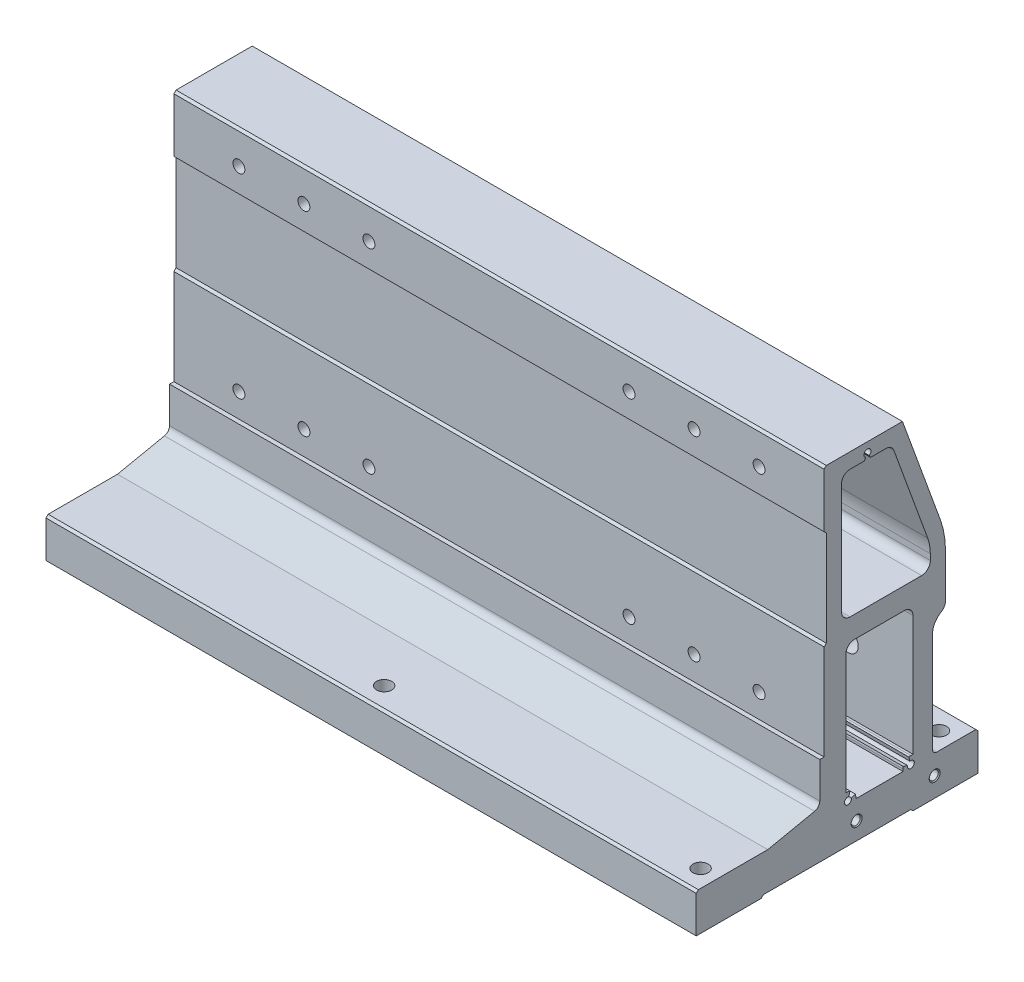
from build123d import *

# Parameters (mm, degrees)
EXTRUDE_1_DEPTH                = 150
HOLE_WIZARD_M5_1_D             = 4.2
HOLE_WIZARD_M5_1_DEPTH         = 12
HOLE_WIZARD_M5_1_CSINK_D       = 5.05
HOLE_WIZARD_M5_1_CSINK_ANGLE   = 90
HOLE_WIZARD_M5_1_TIP           = 1.2618073
HOLE_WIZARD_M5_1_2_D           = 5.5
HOLE_WIZARD_M5_1_2_CBORE_D     = 9.5
HOLE_WIZARD_M5_1_2_CBORE_DEPTH = 49
PATTERN_LINEAR_1_COUNT         = 2
PATTERN_LINEAR_1_PITCH         = 180
F_5_0MM_1_D                    = 5
F_5_0MM_1_DEPTH                = 10
F_5_0MM_1_TIP                  = 1.502151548
HOLE_WIZARD_7_0_7_1_D          = 7


with BuildPart() as part:
    # Sketch 2 → Extrude 1 (new, symmetric)
    with BuildSketch(Plane(origin=(0, 0, 0), x_dir=(0, 0, -1), z_dir=(1, 0, 0))):
        with BuildLine():
            Line((65, 16), (64, 17))
            Line((64, 17), (46, 17))
            ThreePointArc((46, 17), (44.585786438, 17.585786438), (44, 19))
            Line((44, 19), (44, 65))
            ThreePointArc((44, 65), (45.07179677, 69), (48, 71.92820323))
            ThreePointArc((48, 71.92820323), (49.464101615, 73.392304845), (50, 75.392304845))
            Line((50, 75.392304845), (50, 95.442037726))
            ThreePointArc((50, 95.442037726), (49.391487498, 102.392628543), (47.584464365, 109.131743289))
            Line((47.584464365, 109.131743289), (30.149007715, 156.999997))
            Line((30.149007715, 156.999997), (-5, 156.999997))
            Line((-5, 156.999997), (-6, 155.999997))
            Line((-6, 155.999997), (-6, 131))
            Line((-6, 131), (-5, 130))
            Line((-5, 130), (-5, 86))
            Line((-5, 86), (-6, 85))
            Line((-6, 85), (-6, 40.999831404))
            Line((-6, 40.999831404), (-8, 40.999831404))
            Line((-8, 40.999831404), (-8, 24.439412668))
            ThreePointArc((-8, 24.439412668), (-8.672384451, 22.546741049), (-10.388137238, 21.502471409))
            Line((-10.388137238, 21.502471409), (-32, 17))
            Line((-32, 17), (-64, 17))
            Line((-64, 17), (-65, 16))
            Line((-65, 16), (-65, -1))
            Line((-65, -1), (-35, -1))
            Line((-35, -1), (-34, 0))
            Line((-34, 0), (34, 0))
            Line((34, 0), (35, -1))
            Line((35, -1), (65, -1))
            Line((65, -1), (65, 16))
        make_face()
        with BuildLine():
            Line((2, 146), (2, 95))
            ThreePointArc((2, 95), (3.171572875, 92.171572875), (6, 91))
            Line((6, 91), (39, 91))
            ThreePointArc((39, 91), (41.828427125, 92.171572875), (43, 95))
            Line((43, 95), (43, 97.735875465))
            ThreePointArc((43, 97.735875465), (42.695743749, 101.211170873), (41.792232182, 104.580728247))
            Line((41.792232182, 104.580728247), (26.207110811, 147.368970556))
            ThreePointArc((26.207110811, 147.368970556), (24.742582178, 149.276879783), (22.448664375, 150))
            Line((22.448664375, 150), (15.443373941, 150))
            Line((15.443373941, 150), (14.8, 151.114356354))
            ThreePointArc((14.8, 151.114356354), (14, 154.099997), (13.2, 151.114356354))
            Line((13.2, 151.114356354), (12.556626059, 150))
            Line((12.556626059, 150), (6, 150))
            ThreePointArc((6, 150), (3.171572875, 148.828427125), (2, 146))
        make_face(mode=Mode.SUBTRACT)
        with BuildLine():
            Line((4, 21.6), (4, 77))
            ThreePointArc((4, 77), (5.171572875, 79.828427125), (8, 81))
            Line((8, 81), (31, 81))
            ThreePointArc((31, 81), (33.828427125, 79.828427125), (35, 77))
            Line((35, 77), (35, 21.6))
            Line((35, 21.6), (34, 21.6))
            ThreePointArc((34, 21.6), (33.530105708, 21.569201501), (33.068251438, 21.477332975))
            Line((33.068251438, 21.477332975), (33.585889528, 19.545481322))
            ThreePointArc((33.585889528, 19.545481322), (35.13137085, 16.86862915), (32.454518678, 18.414110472))
            Line((32.454518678, 18.414110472), (30.522667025, 18.931748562))
            ThreePointArc((30.522667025, 18.931748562), (30.430798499, 18.469894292), (30.4, 18))
            Line((30.4, 18), (30.4, 17))
            Line((30.4, 17), (8.6, 17))
            Line((8.6, 17), (8.6, 18))
            ThreePointArc((8.6, 18), (8.569201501, 18.469894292), (8.477332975, 18.931748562))
            Line((8.477332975, 18.931748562), (6.545481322, 18.414110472))
            ThreePointArc((6.545481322, 18.414110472), (3.86862915, 16.86862915), (5.414110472, 19.545481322))
            Line((5.414110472, 19.545481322), (5.931748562, 21.477332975))
            ThreePointArc((5.931748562, 21.477332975), (5.469894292, 21.569201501), (5, 21.6))
            Line((5, 21.6), (4, 21.6))
        make_face(mode=Mode.SUBTRACT)
    extrude(amount=EXTRUDE_1_DEPTH, both=True)

    # Hole Wizard M5 _ _1
    with Locations(Plane(origin=(150, 0, 0), x_dir=(0, 0, -1), z_dir=(1, 0, 0))):
        with Locations((45, 8), (9, 8)):
            CounterSinkHole(HOLE_WIZARD_M5_1_D / 2, HOLE_WIZARD_M5_1_CSINK_D / 2, depth=HOLE_WIZARD_M5_1_DEPTH, counter_sink_angle=HOLE_WIZARD_M5_1_CSINK_ANGLE)
            with Locations((0, 0, -(HOLE_WIZARD_M5_1_DEPTH + HOLE_WIZARD_M5_1_TIP / 2))):  # 118° drill point
                Cone(0, HOLE_WIZARD_M5_1_D / 2, HOLE_WIZARD_M5_1_TIP, mode=Mode.SUBTRACT)

    # Hole Wizard M5 _ _ _ _ _1 2 (through all)
    with Locations(Plane(origin=(0, 0, -50), x_dir=(-1, 0, 0), z_dir=(0, 0, -1))):
        with Locations((-120, 142), (-90, 142), (-60, 142), (-120, 52), (-90, 52), (-60, 52)):
            hole_wizard_m5_1_2 = CounterBoreHole(HOLE_WIZARD_M5_1_2_D / 2, HOLE_WIZARD_M5_1_2_CBORE_D / 2, HOLE_WIZARD_M5_1_2_CBORE_DEPTH)

    # Pattern Linear 1: Hole Wizard M5 _ _ _ _ _1 2 ×2
    with Locations(*[(-i * PATTERN_LINEAR_1_PITCH, 0, 0) for i in range(1, PATTERN_LINEAR_1_COUNT)]):
        add(hole_wizard_m5_1_2, mode=Mode.SUBTRACT)

    # 5.0mm _ _1
    with Locations(Plane(origin=(0, 0, 0), x_dir=(-1, 0, 0), z_dir=(0, -1, 0))):
        with Locations((4, 0), (-142, 0)):
            Hole(F_5_0MM_1_D / 2, depth=F_5_0MM_1_DEPTH)
            with Locations((0, 0, -(F_5_0MM_1_DEPTH + F_5_0MM_1_TIP / 2))):  # 118° drill point
                Cone(0, F_5_0MM_1_D / 2, F_5_0MM_1_TIP, mode=Mode.SUBTRACT)

    # Hole Wizard 7.0 _7_ _ _1 (through all)
    with Locations(Plane(origin=(0, -1, 0), x_dir=(-1, 0, 0), z_dir=(0, -1, 0))):
        with Locations((4, -55), (4, 55), (-142, 55), (-142, -55)):
            Hole(HOLE_WIZARD_7_0_7_1_D / 2)


solid = part.part
